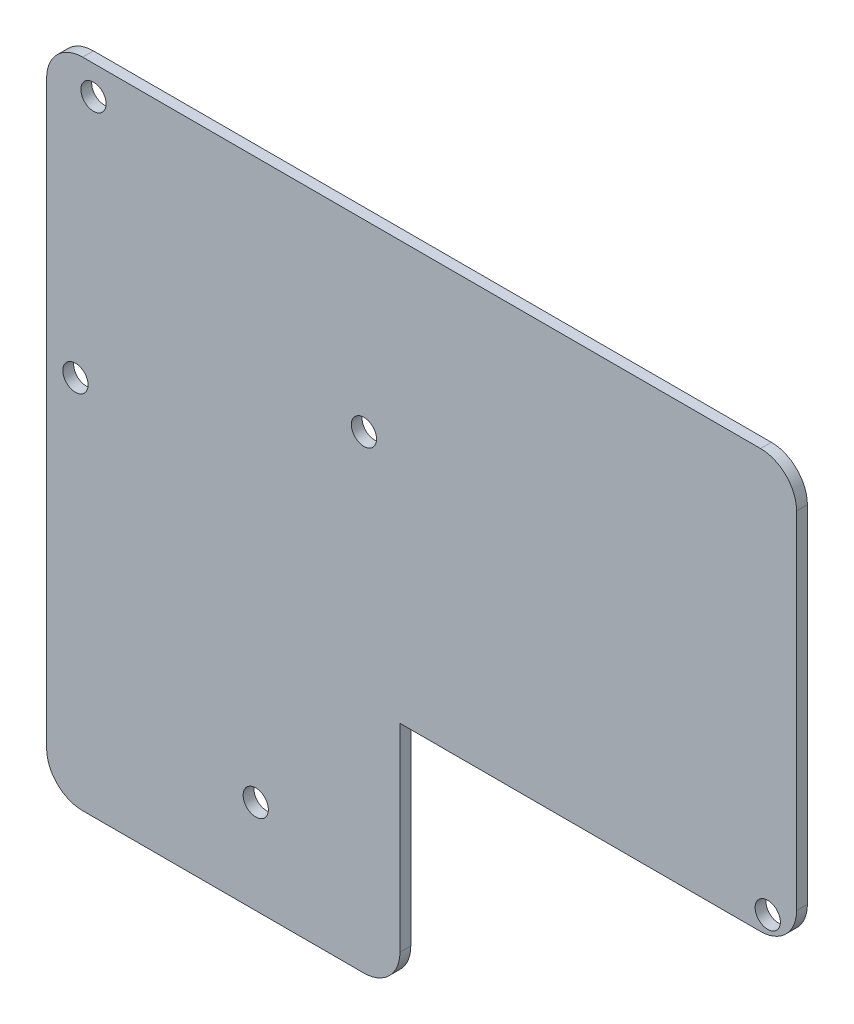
ISO-10303-21;
HEADER;
FILE_DESCRIPTION(('STEP AP214'),'2;1');
FILE_NAME('part.step','',(''),(''),'','','');
FILE_SCHEMA(('AUTOMOTIVE_DESIGN { 1 0 10303 214 1 1 1 1 }'));
ENDSEC;
DATA;
#1=APPLICATION_CONTEXT('core data for automotive mechanical design processes');
#2=APPLICATION_PROTOCOL_DEFINITION('international standard','automotive_design',2000,#1);
#3=PRODUCT_CONTEXT('',#1,'mechanical');
#4=PRODUCT('Part','Part','',(#3));
#5=PRODUCT_RELATED_PRODUCT_CATEGORY('part','',(#4));
#6=PRODUCT_DEFINITION_FORMATION('','',#4);
#7=PRODUCT_DEFINITION_CONTEXT('part definition',#1,'design');
#8=PRODUCT_DEFINITION('design','',#6,#7);
#9=PRODUCT_DEFINITION_SHAPE('','',#8);
#10=(LENGTH_UNIT() NAMED_UNIT(*) SI_UNIT(.MILLI.,.METRE.));
#11=(NAMED_UNIT(*) PLANE_ANGLE_UNIT() SI_UNIT($,.RADIAN.));
#12=(NAMED_UNIT(*) SI_UNIT($,.STERADIAN.) SOLID_ANGLE_UNIT());
#13=UNCERTAINTY_MEASURE_WITH_UNIT(LENGTH_MEASURE(1.E-05),#10,'distance_accuracy_value','');
#14=(GEOMETRIC_REPRESENTATION_CONTEXT(3) GLOBAL_UNCERTAINTY_ASSIGNED_CONTEXT((#13)) GLOBAL_UNIT_ASSIGNED_CONTEXT((#10,
#11,#12)) REPRESENTATION_CONTEXT('',''));
#15=CARTESIAN_POINT('',(0.,0.,0.));
#16=DIRECTION('',(0.,0.,1.));
#17=DIRECTION('',(1.,0.,0.));
#18=AXIS2_PLACEMENT_3D('',#15,#16,#17);
#19=CARTESIAN_POINT('',(0.,0.,3.));
#20=DIRECTION('',(-1.,0.,0.));
#21=DIRECTION('',(0.,0.,1.));
#22=AXIS2_PLACEMENT_3D('',#19,#20,#21);
#23=PLANE('',#22);
#24=DIRECTION('',(0.,1.,0.));
#25=VECTOR('',#24,1.);
#26=CARTESIAN_POINT('',(0.,0.,0.));
#27=LINE('',#26,#25);
#28=CARTESIAN_POINT('',(0.,-158.,0.));
#29=VERTEX_POINT('',#28);
#30=CARTESIAN_POINT('',(0.,3.,0.));
#31=VERTEX_POINT('',#30);
#32=EDGE_CURVE('E162',#29,#31,#27,.T.);
#33=ORIENTED_EDGE('',*,*,#32,.F.);
#34=DIRECTION('',(0.,0.,-1.));
#35=VECTOR('',#34,1.);
#36=CARTESIAN_POINT('',(0.,-158.,3.));
#37=LINE('',#36,#35);
#38=CARTESIAN_POINT('',(0.,-158.,3.));
#39=VERTEX_POINT('',#38);
#40=EDGE_CURVE('E218',#29,#39,#37,.F.);
#41=ORIENTED_EDGE('',*,*,#40,.T.);
#42=DIRECTION('',(0.,1.,0.));
#43=VECTOR('',#42,1.);
#44=CARTESIAN_POINT('',(0.,0.,3.));
#45=LINE('',#44,#43);
#46=CARTESIAN_POINT('',(0.,3.,3.));
#47=VERTEX_POINT('',#46);
#48=EDGE_CURVE('E144',#39,#47,#45,.T.);
#49=ORIENTED_EDGE('',*,*,#48,.T.);
#50=DIRECTION('',(0.,0.,-1.));
#51=VECTOR('',#50,1.);
#52=CARTESIAN_POINT('',(0.,3.,3.));
#53=LINE('',#52,#51);
#54=EDGE_CURVE('E197',#47,#31,#53,.T.);
#55=ORIENTED_EDGE('',*,*,#54,.T.);
#56=EDGE_LOOP('',(#33,#41,#49,#55));
#57=FACE_BOUND('',#56,.T.);
#58=ADVANCED_FACE('F35',(#57),#23,.T.);
#59=CARTESIAN_POINT('',(0.,-168.,3.));
#60=DIRECTION('',(0.,-1.,0.));
#61=DIRECTION('',(0.,0.,-1.));
#62=AXIS2_PLACEMENT_3D('',#59,#60,#61);
#63=PLANE('',#62);
#64=DIRECTION('',(-1.,0.,0.));
#65=VECTOR('',#64,1.);
#66=CARTESIAN_POINT('',(0.,-168.,3.));
#67=LINE('',#66,#65);
#68=CARTESIAN_POINT('',(88.,-168.,3.));
#69=VERTEX_POINT('',#68);
#70=CARTESIAN_POINT('',(10.,-168.,3.));
#71=VERTEX_POINT('',#70);
#72=EDGE_CURVE('E141',#69,#71,#67,.T.);
#73=ORIENTED_EDGE('',*,*,#72,.T.);
#74=DIRECTION('',(0.,0.,-1.));
#75=VECTOR('',#74,1.);
#76=CARTESIAN_POINT('',(10.,-168.,3.));
#77=LINE('',#76,#75);
#78=CARTESIAN_POINT('',(10.,-168.,0.));
#79=VERTEX_POINT('',#78);
#80=EDGE_CURVE('E209',#71,#79,#77,.T.);
#81=ORIENTED_EDGE('',*,*,#80,.T.);
#82=DIRECTION('',(-1.,0.,0.));
#83=VECTOR('',#82,1.);
#84=CARTESIAN_POINT('',(0.,-168.,0.));
#85=LINE('',#84,#83);
#86=CARTESIAN_POINT('',(88.,-168.,0.));
#87=VERTEX_POINT('',#86);
#88=EDGE_CURVE('E164',#87,#79,#85,.T.);
#89=ORIENTED_EDGE('',*,*,#88,.F.);
#90=DIRECTION('',(0.,0.,-1.));
#91=VECTOR('',#90,1.);
#92=CARTESIAN_POINT('',(88.,-168.,3.));
#93=LINE('',#92,#91);
#94=EDGE_CURVE('E207',#87,#69,#93,.F.);
#95=ORIENTED_EDGE('',*,*,#94,.T.);
#96=EDGE_LOOP('',(#73,#81,#89,#95));
#97=FACE_BOUND('',#96,.T.);
#98=ADVANCED_FACE('F280',(#97),#63,.T.);
#99=CARTESIAN_POINT('',(98.,0.,3.));
#100=DIRECTION('',(1.,0.,0.));
#101=DIRECTION('',(0.,0.,-1.));
#102=AXIS2_PLACEMENT_3D('',#99,#100,#101);
#103=PLANE('',#102);
#104=DIRECTION('',(0.,-1.,0.));
#105=VECTOR('',#104,1.);
#106=CARTESIAN_POINT('',(98.,0.,3.));
#107=LINE('',#106,#105);
#108=CARTESIAN_POINT('',(98.,-103.,3.));
#109=VERTEX_POINT('',#108);
#110=CARTESIAN_POINT('',(98.,-158.,3.));
#111=VERTEX_POINT('',#110);
#112=EDGE_CURVE('E123',#109,#111,#107,.T.);
#113=ORIENTED_EDGE('',*,*,#112,.T.);
#114=DIRECTION('',(0.,0.,-1.));
#115=VECTOR('',#114,1.);
#116=CARTESIAN_POINT('',(98.,-158.,3.));
#117=LINE('',#116,#115);
#118=CARTESIAN_POINT('',(98.,-158.,0.));
#119=VERTEX_POINT('',#118);
#120=EDGE_CURVE('E224',#111,#119,#117,.T.);
#121=ORIENTED_EDGE('',*,*,#120,.T.);
#122=DIRECTION('',(0.,-1.,0.));
#123=VECTOR('',#122,1.);
#124=CARTESIAN_POINT('',(98.,0.,0.));
#125=LINE('',#124,#123);
#126=CARTESIAN_POINT('',(98.,-103.,0.));
#127=VERTEX_POINT('',#126);
#128=EDGE_CURVE('E131',#127,#119,#125,.T.);
#129=ORIENTED_EDGE('',*,*,#128,.F.);
#130=DIRECTION('',(0.,0.,-1.));
#131=VECTOR('',#130,1.);
#132=CARTESIAN_POINT('',(98.,-103.,3.));
#133=LINE('',#132,#131);
#134=EDGE_CURVE('E119',#109,#127,#133,.T.);
#135=ORIENTED_EDGE('',*,*,#134,.F.);
#136=EDGE_LOOP('',(#113,#121,#129,#135));
#137=FACE_BOUND('',#136,.T.);
#138=ADVANCED_FACE('F127',(#137),#103,.T.);
#139=CARTESIAN_POINT('',(0.,-103.,3.));
#140=DIRECTION('',(0.,-1.,0.));
#141=DIRECTION('',(0.,0.,-1.));
#142=AXIS2_PLACEMENT_3D('',#139,#140,#141);
#143=PLANE('',#142);
#144=DIRECTION('',(-1.,0.,0.));
#145=VECTOR('',#144,1.);
#146=CARTESIAN_POINT('',(0.,-103.,0.));
#147=LINE('',#146,#145);
#148=CARTESIAN_POINT('',(198.,-103.,0.));
#149=VERTEX_POINT('',#148);
#150=EDGE_CURVE('E169',#149,#127,#147,.T.);
#151=ORIENTED_EDGE('',*,*,#150,.F.);
#152=DIRECTION('',(0.,0.,-1.));
#153=VECTOR('',#152,1.);
#154=CARTESIAN_POINT('',(198.,-103.,3.));
#155=LINE('',#154,#153);
#156=CARTESIAN_POINT('',(198.,-103.,3.));
#157=VERTEX_POINT('',#156);
#158=EDGE_CURVE('E11',#149,#157,#155,.F.);
#159=ORIENTED_EDGE('',*,*,#158,.T.);
#160=DIRECTION('',(-1.,0.,0.));
#161=VECTOR('',#160,1.);
#162=CARTESIAN_POINT('',(0.,-103.,3.));
#163=LINE('',#162,#161);
#164=EDGE_CURVE('E116',#157,#109,#163,.T.);
#165=ORIENTED_EDGE('',*,*,#164,.T.);
#166=ORIENTED_EDGE('',*,*,#134,.T.);
#167=EDGE_LOOP('',(#151,#159,#165,#166));
#168=FACE_BOUND('',#167,.T.);
#169=ADVANCED_FACE('F118',(#168),#143,.T.);
#170=CARTESIAN_POINT('',(208.,0.,3.));
#171=DIRECTION('',(1.,0.,0.));
#172=DIRECTION('',(0.,0.,-1.));
#173=AXIS2_PLACEMENT_3D('',#170,#171,#172);
#174=PLANE('',#173);
#175=DIRECTION('',(0.,-1.,0.));
#176=VECTOR('',#175,1.);
#177=CARTESIAN_POINT('',(208.,0.,3.));
#178=LINE('',#177,#176);
#179=CARTESIAN_POINT('',(208.,3.,3.));
#180=VERTEX_POINT('',#179);
#181=CARTESIAN_POINT('',(208.,-93.,3.));
#182=VERTEX_POINT('',#181);
#183=EDGE_CURVE('E122',#180,#182,#178,.T.);
#184=ORIENTED_EDGE('',*,*,#183,.T.);
#185=DIRECTION('',(0.,0.,-1.));
#186=VECTOR('',#185,1.);
#187=CARTESIAN_POINT('',(208.,-93.,3.));
#188=LINE('',#187,#186);
#189=CARTESIAN_POINT('',(208.,-93.,0.));
#190=VERTEX_POINT('',#189);
#191=EDGE_CURVE('E43',#182,#190,#188,.T.);
#192=ORIENTED_EDGE('',*,*,#191,.T.);
#193=DIRECTION('',(0.,-1.,0.));
#194=VECTOR('',#193,1.);
#195=CARTESIAN_POINT('',(208.,0.,0.));
#196=LINE('',#195,#194);
#197=CARTESIAN_POINT('',(208.,3.,0.));
#198=VERTEX_POINT('',#197);
#199=EDGE_CURVE('E171',#198,#190,#196,.T.);
#200=ORIENTED_EDGE('',*,*,#199,.F.);
#201=DIRECTION('',(0.,0.,-1.));
#202=VECTOR('',#201,1.);
#203=CARTESIAN_POINT('',(208.,3.,3.));
#204=LINE('',#203,#202);
#205=EDGE_CURVE('E192',#198,#180,#204,.F.);
#206=ORIENTED_EDGE('',*,*,#205,.T.);
#207=EDGE_LOOP('',(#184,#192,#200,#206));
#208=FACE_BOUND('',#207,.T.);
#209=ADVANCED_FACE('F229',(#208),#174,.T.);
#210=CARTESIAN_POINT('',(8.00000000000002,-65.,3.));
#211=DIRECTION('',(0.,0.,-1.));
#212=DIRECTION('',(-1.,0.,0.));
#213=AXIS2_PLACEMENT_3D('',#210,#211,#212);
#214=CYLINDRICAL_SURFACE('',#213,3.5);
#215=CARTESIAN_POINT('',(8.00000000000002,-65.,3.));
#216=DIRECTION('',(0.,0.,1.));
#217=DIRECTION('',(1.,0.,0.));
#218=AXIS2_PLACEMENT_3D('',#215,#216,#217);
#219=CIRCLE('',#218,3.5);
#220=CARTESIAN_POINT('',(11.5,-65.,3.));
#221=VERTEX_POINT('',#220);
#222=EDGE_CURVE('E157',#221,#221,#219,.T.);
#223=ORIENTED_EDGE('',*,*,#222,.T.);
#224=EDGE_LOOP('',(#223));
#225=FACE_BOUND('',#224,.T.);
#226=CARTESIAN_POINT('',(8.00000000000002,-65.,0.));
#227=DIRECTION('',(0.,0.,1.));
#228=DIRECTION('',(1.,0.,0.));
#229=AXIS2_PLACEMENT_3D('',#226,#227,#228);
#230=CIRCLE('',#229,3.5);
#231=CARTESIAN_POINT('',(11.5,-65.,0.));
#232=VERTEX_POINT('',#231);
#233=EDGE_CURVE('E182',#232,#232,#230,.T.);
#234=ORIENTED_EDGE('',*,*,#233,.F.);
#235=EDGE_LOOP('',(#234));
#236=FACE_BOUND('',#235,.T.);
#237=ADVANCED_FACE('F376',(#225,#236),#214,.F.);
#238=CARTESIAN_POINT('',(58.,-142.,3.));
#239=DIRECTION('',(0.,0.,-1.));
#240=DIRECTION('',(-1.,0.,0.));
#241=AXIS2_PLACEMENT_3D('',#238,#239,#240);
#242=CYLINDRICAL_SURFACE('',#241,3.5);
#243=CARTESIAN_POINT('',(58.,-142.,3.));
#244=DIRECTION('',(0.,0.,1.));
#245=DIRECTION('',(1.,0.,0.));
#246=AXIS2_PLACEMENT_3D('',#243,#244,#245);
#247=CIRCLE('',#246,3.5);
#248=CARTESIAN_POINT('',(61.5,-142.,3.));
#249=VERTEX_POINT('',#248);
#250=EDGE_CURVE('E154',#249,#249,#247,.T.);
#251=ORIENTED_EDGE('',*,*,#250,.T.);
#252=EDGE_LOOP('',(#251));
#253=FACE_BOUND('',#252,.T.);
#254=CARTESIAN_POINT('',(58.,-142.,0.));
#255=DIRECTION('',(0.,0.,1.));
#256=DIRECTION('',(1.,0.,0.));
#257=AXIS2_PLACEMENT_3D('',#254,#255,#256);
#258=CIRCLE('',#257,3.5);
#259=CARTESIAN_POINT('',(61.5,-142.,0.));
#260=VERTEX_POINT('',#259);
#261=EDGE_CURVE('E179',#260,#260,#258,.T.);
#262=ORIENTED_EDGE('',*,*,#261,.F.);
#263=EDGE_LOOP('',(#262));
#264=FACE_BOUND('',#263,.T.);
#265=ADVANCED_FACE('F368',(#253,#264),#242,.F.);
#266=CARTESIAN_POINT('',(88.,-38.,3.));
#267=DIRECTION('',(0.,0.,-1.));
#268=DIRECTION('',(-1.,0.,0.));
#269=AXIS2_PLACEMENT_3D('',#266,#267,#268);
#270=CYLINDRICAL_SURFACE('',#269,3.50000000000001);
#271=CARTESIAN_POINT('',(88.,-38.,3.));
#272=DIRECTION('',(0.,0.,1.));
#273=DIRECTION('',(1.,0.,0.));
#274=AXIS2_PLACEMENT_3D('',#271,#272,#273);
#275=CIRCLE('',#274,3.50000000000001);
#276=CARTESIAN_POINT('',(91.5,-38.,3.));
#277=VERTEX_POINT('',#276);
#278=EDGE_CURVE('E151',#277,#277,#275,.T.);
#279=ORIENTED_EDGE('',*,*,#278,.T.);
#280=EDGE_LOOP('',(#279));
#281=FACE_BOUND('',#280,.T.);
#282=CARTESIAN_POINT('',(88.,-38.,0.));
#283=DIRECTION('',(0.,0.,1.));
#284=DIRECTION('',(1.,0.,0.));
#285=AXIS2_PLACEMENT_3D('',#282,#283,#284);
#286=CIRCLE('',#285,3.50000000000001);
#287=CARTESIAN_POINT('',(91.5,-38.,0.));
#288=VERTEX_POINT('',#287);
#289=EDGE_CURVE('E176',#288,#288,#286,.T.);
#290=ORIENTED_EDGE('',*,*,#289,.F.);
#291=EDGE_LOOP('',(#290));
#292=FACE_BOUND('',#291,.T.);
#293=ADVANCED_FACE('F348',(#281,#292),#270,.F.);
#294=CARTESIAN_POINT('',(0.,13.,3.));
#295=DIRECTION('',(0.,1.,0.));
#296=DIRECTION('',(0.,0.,1.));
#297=AXIS2_PLACEMENT_3D('',#294,#295,#296);
#298=PLANE('',#297);
#299=DIRECTION('',(1.,0.,0.));
#300=VECTOR('',#299,1.);
#301=CARTESIAN_POINT('',(0.,13.,0.));
#302=LINE('',#301,#300);
#303=CARTESIAN_POINT('',(10.,13.,0.));
#304=VERTEX_POINT('',#303);
#305=CARTESIAN_POINT('',(198.,13.,0.));
#306=VERTEX_POINT('',#305);
#307=EDGE_CURVE('E174',#304,#306,#302,.T.);
#308=ORIENTED_EDGE('',*,*,#307,.F.);
#309=DIRECTION('',(0.,0.,-1.));
#310=VECTOR('',#309,1.);
#311=CARTESIAN_POINT('',(10.,13.,3.));
#312=LINE('',#311,#310);
#313=CARTESIAN_POINT('',(10.,13.,3.));
#314=VERTEX_POINT('',#313);
#315=EDGE_CURVE('E202',#304,#314,#312,.F.);
#316=ORIENTED_EDGE('',*,*,#315,.T.);
#317=DIRECTION('',(1.,0.,0.));
#318=VECTOR('',#317,1.);
#319=CARTESIAN_POINT('',(0.,13.,3.));
#320=LINE('',#319,#318);
#321=CARTESIAN_POINT('',(198.,13.,3.));
#322=VERTEX_POINT('',#321);
#323=EDGE_CURVE('E149',#314,#322,#320,.T.);
#324=ORIENTED_EDGE('',*,*,#323,.T.);
#325=DIRECTION('',(0.,0.,-1.));
#326=VECTOR('',#325,1.);
#327=CARTESIAN_POINT('',(198.,13.,3.));
#328=LINE('',#327,#326);
#329=EDGE_CURVE('E132',#322,#306,#328,.T.);
#330=ORIENTED_EDGE('',*,*,#329,.T.);
#331=EDGE_LOOP('',(#308,#316,#324,#330));
#332=FACE_BOUND('',#331,.T.);
#333=ADVANCED_FACE('F242',(#332),#298,.T.);
#334=CARTESIAN_POINT('',(200.,-98.,3.));
#335=DIRECTION('',(0.,0.,-1.));
#336=DIRECTION('',(-1.,0.,0.));
#337=AXIS2_PLACEMENT_3D('',#334,#335,#336);
#338=CYLINDRICAL_SURFACE('',#337,3.49999999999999);
#339=CARTESIAN_POINT('',(200.,-98.,3.));
#340=DIRECTION('',(0.,0.,1.));
#341=DIRECTION('',(1.,0.,0.));
#342=AXIS2_PLACEMENT_3D('',#339,#340,#341);
#343=CIRCLE('',#342,3.49999999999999);
#344=CARTESIAN_POINT('',(203.5,-98.,3.));
#345=VERTEX_POINT('',#344);
#346=EDGE_CURVE('E133',#345,#345,#343,.T.);
#347=ORIENTED_EDGE('',*,*,#346,.T.);
#348=EDGE_LOOP('',(#347));
#349=FACE_BOUND('',#348,.T.);
#350=CARTESIAN_POINT('',(200.,-98.,0.));
#351=DIRECTION('',(0.,0.,1.));
#352=DIRECTION('',(1.,0.,0.));
#353=AXIS2_PLACEMENT_3D('',#350,#351,#352);
#354=CIRCLE('',#353,3.49999999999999);
#355=CARTESIAN_POINT('',(203.5,-98.,0.));
#356=VERTEX_POINT('',#355);
#357=EDGE_CURVE('E185',#356,#356,#354,.T.);
#358=ORIENTED_EDGE('',*,*,#357,.F.);
#359=EDGE_LOOP('',(#358));
#360=FACE_BOUND('',#359,.T.);
#361=ADVANCED_FACE('F269',(#349,#360),#338,.F.);
#362=CARTESIAN_POINT('',(0.,0.,3.));
#363=DIRECTION('',(0.,0.,1.));
#364=DIRECTION('',(1.,0.,0.));
#365=AXIS2_PLACEMENT_3D('',#362,#363,#364);
#366=PLANE('',#365);
#367=CARTESIAN_POINT('',(13.,5.,3.));
#368=DIRECTION('',(0.,0.,1.));
#369=DIRECTION('',(1.,0.,0.));
#370=AXIS2_PLACEMENT_3D('',#367,#368,#369);
#371=CIRCLE('',#370,3.5);
#372=CARTESIAN_POINT('',(16.5,5.,3.));
#373=VERTEX_POINT('',#372);
#374=EDGE_CURVE('E255',#373,#373,#371,.T.);
#375=ORIENTED_EDGE('',*,*,#374,.F.);
#376=EDGE_LOOP('',(#375));
#377=FACE_BOUND('',#376,.T.);
#378=ORIENTED_EDGE('',*,*,#48,.F.);
#379=CARTESIAN_POINT('',(10.,-158.,3.));
#380=DIRECTION('',(0.,0.,1.));
#381=DIRECTION('',(1.,0.,0.));
#382=AXIS2_PLACEMENT_3D('',#379,#380,#381);
#383=CIRCLE('',#382,10.);
#384=EDGE_CURVE('E222',#39,#71,#383,.T.);
#385=ORIENTED_EDGE('',*,*,#384,.T.);
#386=ORIENTED_EDGE('',*,*,#72,.F.);
#387=CARTESIAN_POINT('',(88.,-158.,3.));
#388=DIRECTION('',(0.,0.,1.));
#389=DIRECTION('',(1.,0.,0.));
#390=AXIS2_PLACEMENT_3D('',#387,#388,#389);
#391=CIRCLE('',#390,10.);
#392=EDGE_CURVE('E140',#69,#111,#391,.T.);
#393=ORIENTED_EDGE('',*,*,#392,.T.);
#394=ORIENTED_EDGE('',*,*,#112,.F.);
#395=ORIENTED_EDGE('',*,*,#164,.F.);
#396=CARTESIAN_POINT('',(198.,-93.,3.));
#397=DIRECTION('',(0.,0.,1.));
#398=DIRECTION('',(1.,0.,0.));
#399=AXIS2_PLACEMENT_3D('',#396,#397,#398);
#400=CIRCLE('',#399,10.);
#401=EDGE_CURVE('E50',#157,#182,#400,.T.);
#402=ORIENTED_EDGE('',*,*,#401,.T.);
#403=ORIENTED_EDGE('',*,*,#183,.F.);
#404=CARTESIAN_POINT('',(198.,3.,3.));
#405=DIRECTION('',(0.,0.,1.));
#406=DIRECTION('',(1.,0.,0.));
#407=AXIS2_PLACEMENT_3D('',#404,#405,#406);
#408=CIRCLE('',#407,10.);
#409=EDGE_CURVE('E194',#180,#322,#408,.T.);
#410=ORIENTED_EDGE('',*,*,#409,.T.);
#411=ORIENTED_EDGE('',*,*,#323,.F.);
#412=CARTESIAN_POINT('',(10.,3.,3.));
#413=DIRECTION('',(0.,0.,1.));
#414=DIRECTION('',(1.,0.,0.));
#415=AXIS2_PLACEMENT_3D('',#412,#413,#414);
#416=CIRCLE('',#415,10.);
#417=EDGE_CURVE('E204',#314,#47,#416,.T.);
#418=ORIENTED_EDGE('',*,*,#417,.T.);
#419=EDGE_LOOP('',(#378,#385,#386,#393,#394,#395,#402,#403,#410,#411,#418));
#420=FACE_BOUND('',#419,.T.);
#421=ORIENTED_EDGE('',*,*,#278,.F.);
#422=EDGE_LOOP('',(#421));
#423=FACE_BOUND('',#422,.T.);
#424=ORIENTED_EDGE('',*,*,#250,.F.);
#425=EDGE_LOOP('',(#424));
#426=FACE_BOUND('',#425,.T.);
#427=ORIENTED_EDGE('',*,*,#222,.F.);
#428=EDGE_LOOP('',(#427));
#429=FACE_BOUND('',#428,.T.);
#430=ORIENTED_EDGE('',*,*,#346,.F.);
#431=EDGE_LOOP('',(#430));
#432=FACE_BOUND('',#431,.T.);
#433=ADVANCED_FACE('F136',(#377,#420,#423,#426,#429,#432),#366,.T.);
#434=CARTESIAN_POINT('',(0.,0.,0.));
#435=DIRECTION('',(0.,0.,1.));
#436=DIRECTION('',(1.,0.,0.));
#437=AXIS2_PLACEMENT_3D('',#434,#435,#436);
#438=PLANE('',#437);
#439=CARTESIAN_POINT('',(13.,5.,0.));
#440=DIRECTION('',(0.,0.,1.));
#441=DIRECTION('',(1.,0.,0.));
#442=AXIS2_PLACEMENT_3D('',#439,#440,#441);
#443=CIRCLE('',#442,3.5);
#444=CARTESIAN_POINT('',(16.5,5.,0.));
#445=VERTEX_POINT('',#444);
#446=EDGE_CURVE('E165',#445,#445,#443,.T.);
#447=ORIENTED_EDGE('',*,*,#446,.T.);
#448=EDGE_LOOP('',(#447));
#449=FACE_BOUND('',#448,.T.);
#450=ORIENTED_EDGE('',*,*,#88,.T.);
#451=CARTESIAN_POINT('',(10.,-158.,0.));
#452=DIRECTION('',(0.,0.,1.));
#453=DIRECTION('',(1.,0.,0.));
#454=AXIS2_PLACEMENT_3D('',#451,#452,#453);
#455=CIRCLE('',#454,10.);
#456=EDGE_CURVE('E216',#79,#29,#455,.F.);
#457=ORIENTED_EDGE('',*,*,#456,.T.);
#458=ORIENTED_EDGE('',*,*,#32,.T.);
#459=CARTESIAN_POINT('',(10.,3.,0.));
#460=DIRECTION('',(0.,0.,1.));
#461=DIRECTION('',(1.,0.,0.));
#462=AXIS2_PLACEMENT_3D('',#459,#460,#461);
#463=CIRCLE('',#462,10.);
#464=EDGE_CURVE('E200',#31,#304,#463,.F.);
#465=ORIENTED_EDGE('',*,*,#464,.T.);
#466=ORIENTED_EDGE('',*,*,#307,.T.);
#467=CARTESIAN_POINT('',(198.,3.,0.));
#468=DIRECTION('',(0.,0.,1.));
#469=DIRECTION('',(1.,0.,0.));
#470=AXIS2_PLACEMENT_3D('',#467,#468,#469);
#471=CIRCLE('',#470,10.);
#472=EDGE_CURVE('E190',#306,#198,#471,.F.);
#473=ORIENTED_EDGE('',*,*,#472,.T.);
#474=ORIENTED_EDGE('',*,*,#199,.T.);
#475=CARTESIAN_POINT('',(198.,-93.,0.));
#476=DIRECTION('',(0.,0.,1.));
#477=DIRECTION('',(1.,0.,0.));
#478=AXIS2_PLACEMENT_3D('',#475,#476,#477);
#479=CIRCLE('',#478,10.);
#480=EDGE_CURVE('E212',#190,#149,#479,.F.);
#481=ORIENTED_EDGE('',*,*,#480,.T.);
#482=ORIENTED_EDGE('',*,*,#150,.T.);
#483=ORIENTED_EDGE('',*,*,#128,.T.);
#484=CARTESIAN_POINT('',(88.,-158.,0.));
#485=DIRECTION('',(0.,0.,1.));
#486=DIRECTION('',(1.,0.,0.));
#487=AXIS2_PLACEMENT_3D('',#484,#485,#486);
#488=CIRCLE('',#487,10.);
#489=EDGE_CURVE('E214',#119,#87,#488,.F.);
#490=ORIENTED_EDGE('',*,*,#489,.T.);
#491=EDGE_LOOP('',(#450,#457,#458,#465,#466,#473,#474,#481,#482,#483,#490));
#492=FACE_BOUND('',#491,.T.);
#493=ORIENTED_EDGE('',*,*,#289,.T.);
#494=EDGE_LOOP('',(#493));
#495=FACE_BOUND('',#494,.T.);
#496=ORIENTED_EDGE('',*,*,#261,.T.);
#497=EDGE_LOOP('',(#496));
#498=FACE_BOUND('',#497,.T.);
#499=ORIENTED_EDGE('',*,*,#233,.T.);
#500=EDGE_LOOP('',(#499));
#501=FACE_BOUND('',#500,.T.);
#502=ORIENTED_EDGE('',*,*,#357,.T.);
#503=EDGE_LOOP('',(#502));
#504=FACE_BOUND('',#503,.T.);
#505=ADVANCED_FACE('F233',(#449,#492,#495,#498,#501,#504),#438,.F.);
#506=CARTESIAN_POINT('',(13.,5.,0.));
#507=DIRECTION('',(0.,0.,1.));
#508=DIRECTION('',(1.,0.,0.));
#509=AXIS2_PLACEMENT_3D('',#506,#507,#508);
#510=CYLINDRICAL_SURFACE('',#509,3.5);
#511=ORIENTED_EDGE('',*,*,#446,.F.);
#512=EDGE_LOOP('',(#511));
#513=FACE_BOUND('',#512,.T.);
#514=ORIENTED_EDGE('',*,*,#374,.T.);
#515=EDGE_LOOP('',(#514));
#516=FACE_BOUND('',#515,.T.);
#517=ADVANCED_FACE('F262',(#513,#516),#510,.F.);
#518=CARTESIAN_POINT('',(198.,3.,3.));
#519=DIRECTION('',(0.,0.,-1.));
#520=DIRECTION('',(-1.,0.,0.));
#521=AXIS2_PLACEMENT_3D('',#518,#519,#520);
#522=CYLINDRICAL_SURFACE('',#521,10.);
#523=ORIENTED_EDGE('',*,*,#409,.F.);
#524=ORIENTED_EDGE('',*,*,#205,.F.);
#525=ORIENTED_EDGE('',*,*,#472,.F.);
#526=ORIENTED_EDGE('',*,*,#329,.F.);
#527=EDGE_LOOP('',(#523,#524,#525,#526));
#528=FACE_BOUND('',#527,.T.);
#529=ADVANCED_FACE('F240',(#528),#522,.T.);
#530=CARTESIAN_POINT('',(10.,3.,3.));
#531=DIRECTION('',(0.,0.,-1.));
#532=DIRECTION('',(-1.,0.,0.));
#533=AXIS2_PLACEMENT_3D('',#530,#531,#532);
#534=CYLINDRICAL_SURFACE('',#533,10.);
#535=ORIENTED_EDGE('',*,*,#417,.F.);
#536=ORIENTED_EDGE('',*,*,#315,.F.);
#537=ORIENTED_EDGE('',*,*,#464,.F.);
#538=ORIENTED_EDGE('',*,*,#54,.F.);
#539=EDGE_LOOP('',(#535,#536,#537,#538));
#540=FACE_BOUND('',#539,.T.);
#541=ADVANCED_FACE('F248',(#540),#534,.T.);
#542=CARTESIAN_POINT('',(10.,-158.,3.));
#543=DIRECTION('',(0.,0.,-1.));
#544=DIRECTION('',(-1.,0.,0.));
#545=AXIS2_PLACEMENT_3D('',#542,#543,#544);
#546=CYLINDRICAL_SURFACE('',#545,10.);
#547=ORIENTED_EDGE('',*,*,#384,.F.);
#548=ORIENTED_EDGE('',*,*,#40,.F.);
#549=ORIENTED_EDGE('',*,*,#456,.F.);
#550=ORIENTED_EDGE('',*,*,#80,.F.);
#551=EDGE_LOOP('',(#547,#548,#549,#550));
#552=FACE_BOUND('',#551,.T.);
#553=ADVANCED_FACE('F294',(#552),#546,.T.);
#554=CARTESIAN_POINT('',(88.,-158.,3.));
#555=DIRECTION('',(0.,0.,-1.));
#556=DIRECTION('',(-1.,0.,0.));
#557=AXIS2_PLACEMENT_3D('',#554,#555,#556);
#558=CYLINDRICAL_SURFACE('',#557,10.);
#559=ORIENTED_EDGE('',*,*,#392,.F.);
#560=ORIENTED_EDGE('',*,*,#94,.F.);
#561=ORIENTED_EDGE('',*,*,#489,.F.);
#562=ORIENTED_EDGE('',*,*,#120,.F.);
#563=EDGE_LOOP('',(#559,#560,#561,#562));
#564=FACE_BOUND('',#563,.T.);
#565=ADVANCED_FACE('F296',(#564),#558,.T.);
#566=CARTESIAN_POINT('',(198.,-93.,3.));
#567=DIRECTION('',(0.,0.,-1.));
#568=DIRECTION('',(-1.,0.,0.));
#569=AXIS2_PLACEMENT_3D('',#566,#567,#568);
#570=CYLINDRICAL_SURFACE('',#569,10.);
#571=ORIENTED_EDGE('',*,*,#401,.F.);
#572=ORIENTED_EDGE('',*,*,#158,.F.);
#573=ORIENTED_EDGE('',*,*,#480,.F.);
#574=ORIENTED_EDGE('',*,*,#191,.F.);
#575=EDGE_LOOP('',(#571,#572,#573,#574));
#576=FACE_BOUND('',#575,.T.);
#577=ADVANCED_FACE('F37',(#576),#570,.T.);
#578=CLOSED_SHELL('',(#58,#98,#138,#169,#209,#237,#265,#293,#333,#361,#433,#505,#517,#529,#541,
#553,#565,#577));
#579=MANIFOLD_SOLID_BREP('B2',#578);
#580=ADVANCED_BREP_SHAPE_REPRESENTATION('',(#18,#579),#14);
#581=SHAPE_DEFINITION_REPRESENTATION(#9,#580);
ENDSEC;
END-ISO-10303-21;
